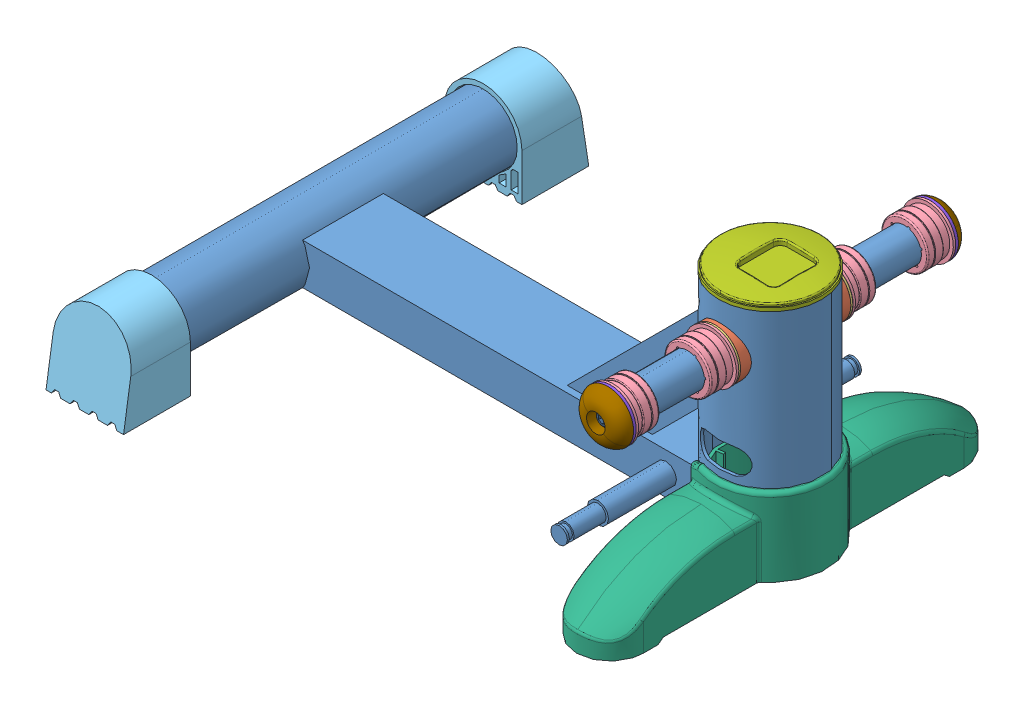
SolidWorks assembly Emsemble stepper.SLDASM, configuration aa (file format 11000). Lengths in mm.
Overall size (411 184 348).
19 component instances, 10 part files, 40 mates.
Components (placement in the parent):
- Chassis-1: Chassis.sldprt [Défaut] at (-186.1837 -56.0959 -159) size (403.75 170.5 318)
- Entretoise_plast_14-1: Entretoise_plast_14.sldprt [Défaut] at (153.8163 50.8041 42.45) x (-1 0 0) z (0 0 -1) size (38 38 9.33)
- Entretoise_plast_14-2: Entretoise_plast_14.sldprt [Défaut] at (153.8163 50.8041 -40.05) size (38 38 9.33)
- Rondelle_15_bis-1: Rondelle_15_bis.sldprt [Défaut] at (153.8163 50.8041 42.45) x (0.999619 0.027587 0) z (0 0 1) size (38 38 1.5)
- Rondelle_15_bis-2: Rondelle_15_bis.sldprt [Défaut] at (153.8163 50.8041 -41.55) x (0.969821 0.243819 0) z (0 0 1) size (38 38 1.5)
- Entretoise-1: Entretoise.sldprt [Défaut] at (153.8163 50.8041 29.15) x (0 0 1) z (0.563639 -0.826021 0) size (19.2 38.4 38.4)
- Entretoise-2: Entretoise.sldprt [Défaut] at (153.8163 50.8041 -26.75) x (0 0 -1) z (-0.998715 -0.050679 0) size (19.2 38.4 38.4)
- Entretoise-3: Entretoise.sldprt [Défaut] at (153.8163 50.8041 -133.1) x (0 0 1) z (-0.713376 0.700782 0) size (19.2 38.4 38.4)
- Entretoise-4: Entretoise.sldprt [Défaut] at (153.8163 50.8041 135.5) x (0 0 -1) z (-0.516902 0.856045 0) size (19.2 38.4 38.4)
- Pied_arriere-1: Pied_arriere.sldprt [Défaut] at (-215.1837 -91.0959 124) size (58 64 50)
- Pied_arriere-2: Pied_arriere.sldprt [Défaut] at (-157.1837 -91.0959 -124) x (-1 0 0) z (0 0 -1) size (58 64 50)
- Pied_avant-1: Pied_avant.sldprt [Défaut] at (153.8163 -91.0959 1.2) x (0 0 -1) z (0 -1 0) size (290 84 61.11)
- Compteur-1: Compteur.sldprt [Défaut] at (153.8163 101.3041 1.2) x (0 -1 0) z (0 0 -1) size (76.6 77 77)
- Rondelle_formee_pedale-1: Rondelle_formee_pedale.sldprt [Défaut] at (153.8163 50.8041 127.7) x (0 0 -1) z (-0.354626 0.935008 0) size (7.04 38.4 38.4)
- Rondelle_formee_pedale-2: Rondelle_formee_pedale.sldprt [Défaut] at (153.8163 50.8041 -125.3) x (0 0 1) z (-0.499449 -0.866343 0) size (7.04 38.4 38.4)
- Cache_plastique_16-1: Cache_plastique_16.sldprt [Défaut] at (153.8163 50.8041 105.2678) x (0 0 1) z (-0.811497 0.584357 0) size (14.29 40.39 40.56)
- Cache_plastique_16-2: Cache_plastique_16.sldprt [Défaut] at (153.8163 50.8041 -102.8678) x (0 0 -1) z (-0.883291 -0.468826 0) size (14.29 40.39 40.56)
- ISO_bhcm_M8x1.25_16.0_16.0_He_Sim_1-1: ISO_bhcm_M8x1.25_16.0_16.0_He_Sim_1.sldprt [Défaut] at (153.8163 50.8041 122.7) x (0.52737 0.849636 0) z (0.849636 -0.52737 0) size (14 20.4 14)
- ISO_bhcm_M8x1.25_16.0_16.0_He_Sim_1-2: ISO_bhcm_M8x1.25_16.0_16.0_He_Sim_1.sldprt [Défaut] at (153.8163 50.8041 -120.3) x (0.695204 -0.718813 0) z (0.718813 0.695204 0) size (14 20.4 14)
Mates (geometry in assembly coordinates):
- Coaxial1: concentric: cylinder of Chassis-1 through (153.8163 50.8041 120.7) axis (0 0 -1) radius 12.75; cylinder of Entretoise_plast_14-1 through (153.8163 50.8041 37.1414) axis (0 0 1) radius 13
- Coaxial2: concentric: cylinder of Entretoise_plast_14-1 through (153.8163 31.5758 1.2) axis (0 1 0) radius 38.25; cylinder of Chassis-1 through (153.8163 84.8041 1.2) axis (0 -1 0) radius 38.25
- Coaxial3: concentric: cylinder of Entretoise_plast_14-2 through (153.8163 50.8041 -34.7414) axis (0 0 -1) radius 13; cylinder of Chassis-1 through (153.8163 50.8041 -34.3618) axis (0 0 -1) radius 12.75
- Coaxial4: concentric: cylinder of Entretoise_plast_14-2 through (153.8163 31.5758 1.2) axis (0 1 0) radius 38.25; cylinder of Chassis-1 through (153.8163 84.8041 1.2) axis (0 -1 0) radius 38.25
- Coaxial5: concentric: cylinder of Chassis-1 through (153.8163 50.8041 120.7) axis (0 0 -1) radius 12.75; cylinder of Rondelle_15_bis-1 through (153.8163 50.8041 43.95) axis (0 0 -1) radius 13.15
- Coaxial6: concentric: cylinder of Rondelle_15_bis-2 through (153.8163 50.8041 -40.05) axis (0 0 -1) radius 13.15; cylinder of Chassis-1 through (153.8163 50.8041 -34.3618) axis (0 0 -1) radius 12.75
- Coïncidente1: coincident: plane of Entretoise_plast_14-1 through (173.0443 31.51 42.45) normal (0 0 1); plane of Rondelle_15_bis-1 through (135.1279 30.9869 42.45) normal (0 0 -1)
- Distance2: distance: plane of Entretoise_plast_14-2 through (134.5883 31.51 -40.05) normal (0 0 -1); plane of Rondelle_15_bis-2 through (139.8728 27.4041 -40.05) normal (0 0 1)
- Coaxial9: concentric: cylinder of Chassis-1 through (153.8163 50.8041 -34.3618) axis (0 0 -1) radius 12.75; cylinder of Entretoise-2 through (153.8163 50.8041 -49.35) axis (0 0 -1) radius 17.5
- Distance4: distance: plane of Rondelle_15_bis-1 through (135.1279 30.9869 43.95) normal (0 0 1); plane of Entretoise-1 through (158.9697 77.8435 43.95) normal (0 0 -1)
- Coaxial12: concentric: cylinder of Entretoise-3 through (153.8163 50.8041 -110.5) axis (0 0 1) radius 17.5; cylinder of Chassis-1 through (153.8163 50.8041 -34.3618) axis (0 0 -1) radius 12.75
- Distance5: distance: plane of Entretoise-4 through (180.5504 44.249 120.7) normal (0 0 1); plane of Rondelle_formee_pedale-1 through (179.0561 39.4715 120.7) normal (0 0 -1)
- Coaxial20: concentric: cylinder of Chassis-1 through (-186.1837 -56.0959 159) axis (0 0 -1) radius 25.5; cylinder of Pied_arriere-1 through (-186.1837 -56.0959 159) axis (0 0 -1) radius 25.5
- Distance21: distance: plane of Chassis-1 through (-212.1443 -82.1013 -159) normal (0 0 -1); plane of Pied_arriere-2 through (-212.1443 -82.1013 -159) normal (0 0 1)
- Parallèle1: parallel: plane of Pied_arriere-2 through (-196.1837 -91.0959 -124) normal (0 -1 0); plane of Chassis-1 through (-165.8591 -71.4959 31.4) normal (0 -1 0)
- Coaxial22: concentric: cylinder of Chassis-1 through (153.8163 84.8041 1.2) axis (0 -1 0) radius 38.25; cylinder of Pied_avant-1 through (153.8163 -33.0959 1.2) axis (0 -1 0) radius 42
- Coaxial23: concentric: cylinder of Chassis-1 through (153.8163 84.8041 1.2) axis (0 -1 0) radius 38.25; cylinder of Compteur-1 through (153.8163 51.8041 1.2) axis (0 1 0) radius 36.1
- Coaxial24: concentric: cylinder of Chassis-1 through (153.8163 50.8041 120.7) axis (0 0 -1) radius 12.75; cone of Rondelle_formee_pedale-1 through (153.8163 50.8041 117.9557) axis (0 0 -1)
- Distance6: distance: plane of Rondelle_15_bis-2 through (139.8728 27.4041 -41.55) normal (0 0 -1); plane of Entretoise-2 through (172.2336 71.2611 -41.55) normal (0 0 1)
- Coaxial25: concentric: cylinder of Chassis-1 through (153.8163 50.8041 120.7) axis (0 0 -1) radius 10.75; cylinder of Rondelle_formee_pedale-2 through (153.8163 50.8041 -113.26) axis (0 0 -1) radius 4
- Distance8: distance: plane of Chassis-1 through (140.836 37.8014 120.7) normal (0 0 1); plane of Rondelle_formee_pedale-1 through (179.0561 39.4715 120.7) normal (0 0 -1)
- Coaxial26: concentric: cylinder of Chassis-1 through (153.8163 50.8041 120.7) axis (0 0 -1) radius 12.75; cylinder of Cache_plastique_16-1 through (153.8163 50.8041 121.2) axis (0 0 1) radius 9.5
- Distance13: distance: plane of Chassis-1 through (140.836 37.8014 -118.3) normal (0 0 -1); plane of Rondelle_formee_pedale-2 through (180.5424 57.9589 -118.3) normal (0 0 1)
- Distance16: distance: plane of Rondelle_formee_pedale-2 through (161.0749 24.1907 -120.3) normal (0 0 -1); plane of Cache_plastique_16-2 through (161.8382 77.1354 -120.3) normal (0 0 1)
- Coaxial38: concentric: cylinder of Rondelle_formee_pedale-2 through (153.8163 50.8041 -113.26) axis (0 0 -1) radius 4; cylinder of Cache_plastique_16-2 through (153.8163 50.8041 -120.8) axis (0 0 -1) radius 7
- Coaxial55: concentric: cylinder of Chassis-1 through (153.8163 50.8041 120.7) axis (0 0 -1) radius 12.75; cylinder of Entretoise-1 through (153.8163 50.8041 58.15) axis (0 0 1) radius 17.5
- Distance12: distance: plane of Rondelle_formee_pedale-1 through (165.2335 75.9162 122.7) normal (0 0 1); plane of Cache_plastique_16-1 through (158.1906 23.6279 122.7) normal (0 0 -1)
- Coaxiale6: concentric: cylinder of Chassis-1 through (153.8163 50.8041 120.7) axis (0 0 -1) radius 12.75; cylinder of Entretoise-4 through (153.8163 50.8041 112.9) axis (0 0 -1) radius 17.5
- Distance18: distance: plane of Entretoise-3 through (154.0141 23.2788 -118.3) normal (0 0 -1); plane of Rondelle_formee_pedale-2 through (180.5424 57.9589 -118.3) normal (0 0 1)
- Coïncidente36: coincident: plane of Chassis-1 through (114.8081 84.8041 -37.7409) normal (0 1 0); plane of Compteur-1 through (192.9123 84.8041 40.162) normal (0 -1 0)
- Coaxiale9: concentric: cylinder of Chassis-1 through (-186.1837 -56.0959 159) axis (0 0 -1) radius 25.5; cylinder of Pied_arriere-2 through (-186.1837 -56.0959 -159) axis (0 0 1) radius 25.5
- Distance23: distance: plane of Chassis-1 through (-212.1443 -82.1013 159) normal (0 0 1); plane of Pied_arriere-1 through (-160.2231 -82.1013 159) normal (0 0 -1)
- Parallèle3: parallel: plane of Chassis-1 through (-165.8591 -71.4959 31.4) normal (0 -1 0); plane of Pied_arriere-1 through (-190.1837 -91.0959 124) normal (0 -1 0)
- Coïncidente40: coincident: plane of Chassis-1 through (114.8081 -85.6959 -37.7409) normal (0 -1 0); plane of Pied_avant-1 through (119.7308 -85.6959 -32.7031) normal (0 1 0)
- Parallèle4: parallel: line of Chassis-1 through (-165.8591 -40.6959 -29) axis (0 0 1); plane of Pied_avant-1 through (128.8163 -49.085 121.2) normal (-1 0 0)
- Parallèle5: parallel: line of Chassis-1 through (-165.8591 -40.6959 -29) axis (0 0 1); plane of Compteur-1 through (143.8163 91.9205 -11.3) normal (1 0 0)
- Coaxiale10: concentric: cylinder of Cache_plastique_16-1 through (153.8163 50.8041 123.2) axis (0 0 1) radius 7; cylinder of ISO_bhcm_M8x1.25_16.0_16.0_He_Sim_1-1 through (153.8163 50.8041 122.7) axis (0 0 -1) radius 4
- Coïncidente41: coincident: plane of Cache_plastique_16-1 through (144.6211 49.2917 122.7) normal (0 0 1); plane of ISO_bhcm_M8x1.25_16.0_16.0_He_Sim_1-1 through (156.0863 41.0287 122.7) normal (0 0 -1)
- Coïncidente42: coincident: plane of Cache_plastique_16-2 through (144.9114 53.5505 -120.3) normal (0 0 -1); plane of ISO_bhcm_M8x1.25_16.0_16.0_He_Sim_1-2 through (153.9666 60.8386 -120.3) normal (0 0 1)
- Coaxiale11: concentric: cylinder of Cache_plastique_16-2 through (153.8163 50.8041 -120.8) axis (0 0 -1) radius 7; cylinder of ISO_bhcm_M8x1.25_16.0_16.0_He_Sim_1-2 through (153.8163 50.8041 -120.3) axis (0 0 1) radius 4
